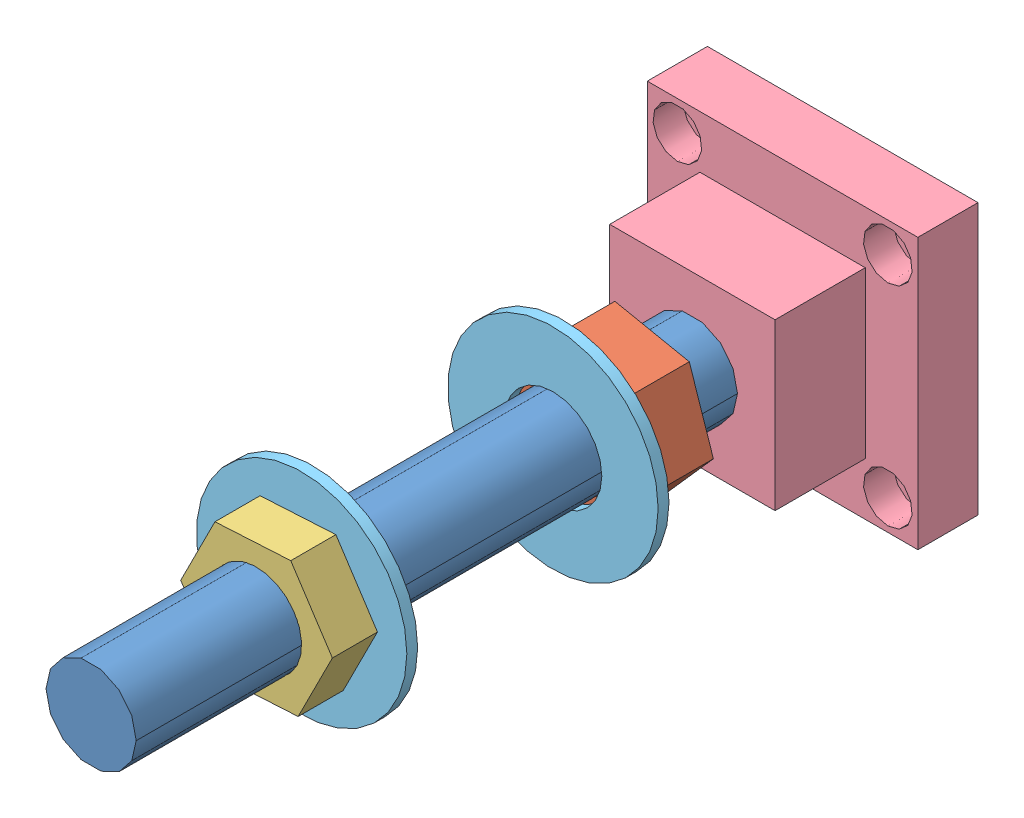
SolidWorks assembly 1080-C1007 Base Pad Support Assy.SLDASM, configuration K1 (file format 5000). Lengths in mm.
Overall size (114.3 114.3 317.5).
10 component instances, 9 part files, 11 mates.
Components (placement in the parent):
- 1080-C1008 Threaded Rod, Support Frame, OSIRIS K2.SLDASM-1: 1080-C1008 Threaded Rod, Support Frame, OSIRIS K2.SLDASM.SLDPRT [Default] at origin
- _U364-2-1: _U364-2.sldprt [Default] at (-0.0192 0 -175.7468) (suppressed, hidden)
- _U365-2-1: _U365-2.sldprt [Default] at (0 0 -192.0875) (suppressed, hidden)
- _U366-2-1: _U366-2.sldprt [Default] at (0 0 -168.275) (suppressed, hidden)
- _U367-2-1: _U367-2.sldprt [Default] at (0.0173 0.0841 -176.2125) (suppressed, hidden)
- _U468-2-1: _U468-2.sldprt [Default] at (0 0 -88.5567) x (0.979916 -0.199413 0) z (0 0 1)
- _U469-2-1: _U469-2.sldprt [Default] at (0 0 47.5873) x (0.45085 0.8926 0) z (0 0 1)
- 1080-C1017 BASE PAD, OSIRIS, KECK 1-1: 1080-C1017 BASE PAD, OSIRIS, KECK 1.SLDPRT [Default] at (-57.15 -57.15 -190.5) x (1 0 0) z (0 -1 0)
- Preferred Wide FW 1.5-1: Preferred Wide FW 1.5.sldprt [Preferred Wide FW 1.5] at (0 0 33.4903) x (0 0 -1) z (1 0 0) size (4.57 88.9 88.9)
- Preferred Wide FW 1.5-2: Preferred Wide FW 1.5.sldprt [Preferred Wide FW 1.5] at (0 0 -72.6817) x (0 0 -1) z (1 0 0) size (4.57 88.9 88.9)
Mates (geometry in assembly coordinates):
- Concentric1: concentric aligned: cylinder of 1080-C1008 Threaded Rod, Support Frame, OSIRIS K2.SLDASM-1 through (0 0 -152.4) axis (0 0 1) radius 19.05; cylinder of 1080-C1017 BASE PAD, OSIRIS, KECK 1-1 through (0 0 -127) axis (0 0 1) radius 12.7
- Parallel1: parallel aligned: plane of 1080-C1017 BASE PAD, OSIRIS, KECK 1-1; plane of assembly through (0 0 0) normal (1 0 0)
- Distance1: distance = 25.4 mm anti-aligned: plane of 1080-C1017 BASE PAD, OSIRIS, KECK 1-1 through (-34.925 34.925 -127) normal (0 0 1); plane of 1080-C1008 Threaded Rod, Support Frame, OSIRIS K2.SLDASM-1 through (0 0 -152.4) normal (0 0 -1)
- Concentric3: concentric aligned: cylinder of 1080-C1008 Threaded Rod, Support Frame, OSIRIS K2.SLDASM-1 through (0 0 -152.4) axis (0 0 1) radius 19.05; cylinder of _U469-2-1 through (0 0 -200.5292) axis (0 0 1) radius 19.05
- Concentric4: concentric aligned: cylinder of 1080-C1008 Threaded Rod, Support Frame, OSIRIS K2.SLDASM-1 through (0 0 -152.4) axis (0 0 1) radius 19.05; cylinder of _U468-2-1 through (0 0 -209.6732) axis (0 0 1) radius 19.05
- Concentric51: concentric aligned: cylinder of 1080-C1008 Threaded Rod, Support Frame, OSIRIS K2.SLDASM-1 through (0 0 -152.4) axis (0 0 1) radius 19.05; cylinder of Preferred Wide FW 1.5-1 through (0 0 68.4153) axis (0 0 1) radius 20.6375
- Concentric61: concentric aligned: cylinder of 1080-C1008 Threaded Rod, Support Frame, OSIRIS K2.SLDASM-1 through (0 0 -152.4) axis (0 0 1) radius 19.05; cylinder of Preferred Wide FW 1.5-2 through (0 0 -37.7567) axis (0 0 1) radius 20.6375
- Coincident1: coincident anti-aligned: plane of _U468-2-1 through (-10.1774 30.4218 -72.6817) normal (0 0 1); plane of Preferred Wide FW 1.5-2 through (0 20.6375 -72.6817) normal (0 0 -1)
- Coincident2: coincident anti-aligned: plane of _U469-2-1 through (0 0 38.0623) normal (0 0 -1); plane of Preferred Wide FW 1.5-1 through (0 44.45 38.0623) normal (0 0 1)
- Distance2: distance = 122.3903 mm anti-aligned: plane of 1080-C1017 BASE PAD, OSIRIS, KECK 1-1 through (-57.15 57.15 -190.5) normal (0 0 -1); plane of Preferred Wide FW 1.5-2 through (0 44.45 -68.1097) normal (0 0 1)
- Distance3: distance = 101.6 mm anti-aligned: plane of Preferred Wide FW 1.5-2 through (0 44.45 -68.1097) normal (0 0 1); plane of Preferred Wide FW 1.5-1 through (0 20.6375 33.4903) normal (0 0 -1)
